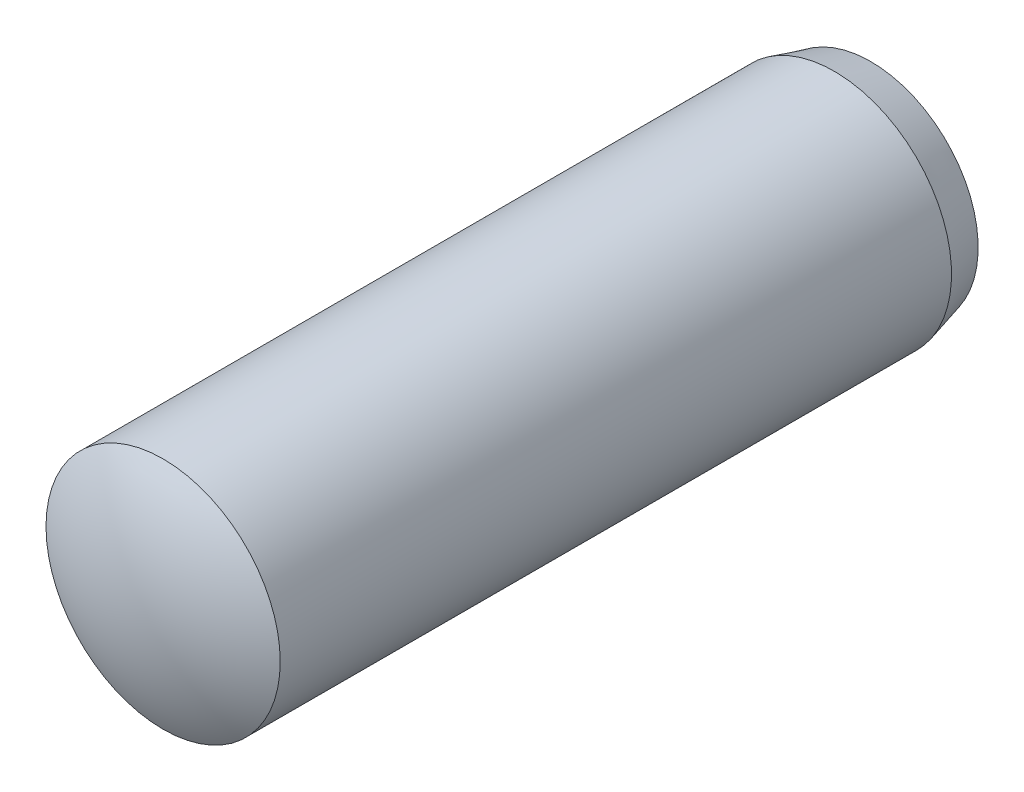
from build123d import *

# Parameters (mm, degrees)
ESQUISSE2_R          = 1.5
BASE_EXTRUSION_DEPTH = 4.9


with BuildPart() as part:
    # Esquisse2 → Base-Extrusion (new, symmetric)
    with BuildSketch(Plane.XY):
        Circle(ESQUISSE2_R)
    extrude(amount=BASE_EXTRUSION_DEPTH, both=True)

    # Esquisse3 → Enlever de la mati_re-R_volution1 (revolve, cut)
    with BuildSketch(Plane(origin=(0, 0, 0), x_dir=(1, 0, 0), z_dir=(0, 1, 0)), mode=Mode.PRIVATE) as enlever_de_la_mati_re_r_volution1_sk:
        Polygon((1.5, 4.9), (1.285640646, 4.9), (1.5, 4.1), align=None)
    revolve(enlever_de_la_mati_re_r_volution1_sk.sketch.rotate(Axis((0, 0, -11.799437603), (0, 0, 1)), 180), axis=Axis((0, 0, -11.799437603), (0, 0, 1)), mode=Mode.SUBTRACT)

    # Esquisse5 → Enlever de la mati_re-R_volution4 (revolve, cut)
    with BuildSketch(Plane(origin=(0, 0, 0), x_dir=(1, 0, 0), z_dir=(0, 1, 0))):
        with BuildLine():
            Line((0, 4.9), (0, 5.4))
            Line((0, 5.4), (-1.15166605, 5.4))
            Line((-1.15166605, 5.4), (-1.37505137, 4.566314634))
            ThreePointArc((-1.37505137, 4.566314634), (-0.707480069, 4.815385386), (0, 4.9))
        make_face()
    revolve(axis=Axis((0, 0, -10.566448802), (0, 0, 1)), mode=Mode.SUBTRACT)

    # Esquisse6 → Enlever de la mati_re-R_volution5 (revolve, cut)
    with BuildSketch(Plane(origin=(0, 0, 0), x_dir=(1, 0, 0), z_dir=(0, 1, 0))):
        with BuildLine():
            Line((-1.5, -4.498076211), (-1.5, -7.9))
            Line((-1.5, -7.9), (0, -7.9))
            Line((0, -7.9), (0, -4.9))
            ThreePointArc((0, -4.9), (-0.776457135, -4.797777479), (-1.5, -4.498076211))
        make_face()
    revolve(axis=Axis((0, 0, 11.863133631), (0, 0, -1)), mode=Mode.SUBTRACT)


solid = part.part
